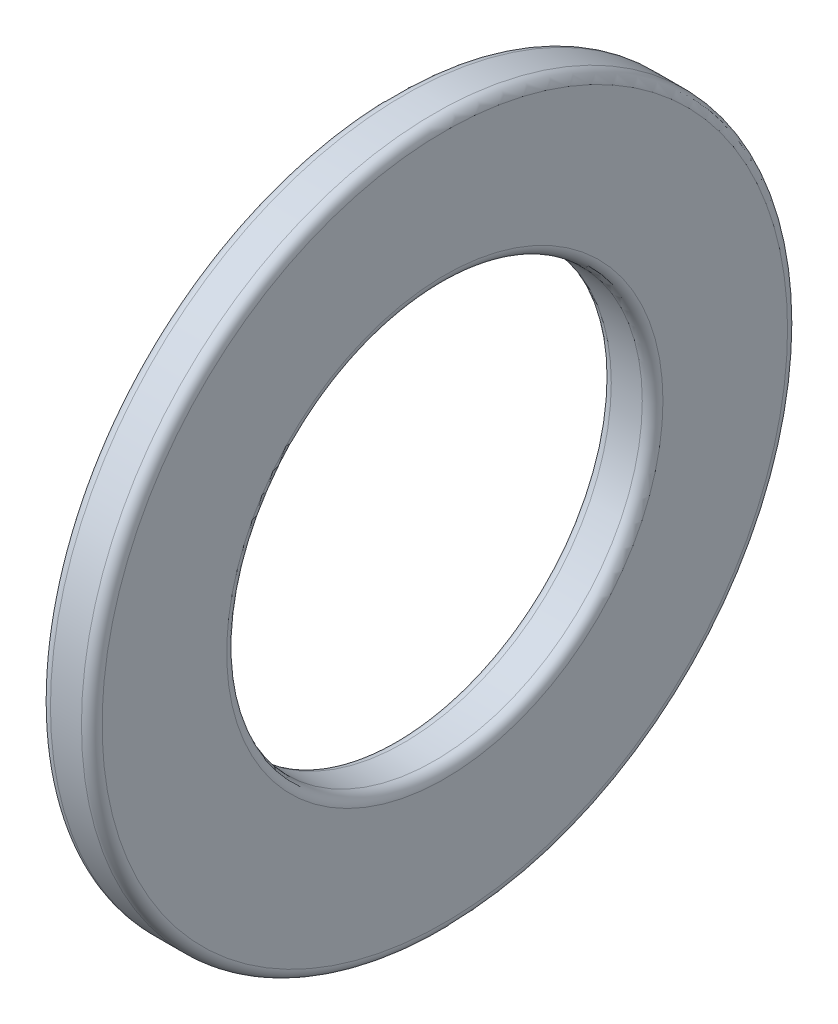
ISO-10303-21;
HEADER;
FILE_DESCRIPTION(('STEP AP214'),'2;1');
FILE_NAME('part.step','',(''),(''),'','','');
FILE_SCHEMA(('AUTOMOTIVE_DESIGN { 1 0 10303 214 1 1 1 1 }'));
ENDSEC;
DATA;
#1=APPLICATION_CONTEXT('core data for automotive mechanical design processes');
#2=APPLICATION_PROTOCOL_DEFINITION('international standard','automotive_design',2000,#1);
#3=PRODUCT_CONTEXT('',#1,'mechanical');
#4=PRODUCT('Part','Part','',(#3));
#5=PRODUCT_RELATED_PRODUCT_CATEGORY('part','',(#4));
#6=PRODUCT_DEFINITION_FORMATION('','',#4);
#7=PRODUCT_DEFINITION_CONTEXT('part definition',#1,'design');
#8=PRODUCT_DEFINITION('design','',#6,#7);
#9=PRODUCT_DEFINITION_SHAPE('','',#8);
#10=(LENGTH_UNIT() NAMED_UNIT(*) SI_UNIT(.MILLI.,.METRE.));
#11=(NAMED_UNIT(*) PLANE_ANGLE_UNIT() SI_UNIT($,.RADIAN.));
#12=(NAMED_UNIT(*) SI_UNIT($,.STERADIAN.) SOLID_ANGLE_UNIT());
#13=UNCERTAINTY_MEASURE_WITH_UNIT(LENGTH_MEASURE(1.E-05),#10,'distance_accuracy_value','');
#14=(GEOMETRIC_REPRESENTATION_CONTEXT(3) GLOBAL_UNCERTAINTY_ASSIGNED_CONTEXT((#13)) GLOBAL_UNIT_ASSIGNED_CONTEXT((#10,
#11,#12)) REPRESENTATION_CONTEXT('',''));
#15=CARTESIAN_POINT('',(0.,0.,0.));
#16=DIRECTION('',(0.,0.,1.));
#17=DIRECTION('',(1.,0.,0.));
#18=AXIS2_PLACEMENT_3D('',#15,#16,#17);
#19=CARTESIAN_POINT('',(0.8128,0.,0.));
#20=DIRECTION('',(1.,0.,0.));
#21=DIRECTION('',(0.,0.,-1.));
#22=AXIS2_PLACEMENT_3D('',#19,#20,#21);
#23=PLANE('',#22);
#24=CARTESIAN_POINT('',(0.8128,0.,0.));
#25=DIRECTION('',(1.,0.,0.));
#26=DIRECTION('',(0.,0.,-1.));
#27=AXIS2_PLACEMENT_3D('',#24,#25,#26);
#28=CIRCLE('',#27,10.78738);
#29=CARTESIAN_POINT('',(0.8128,0.,-10.78738));
#30=VERTEX_POINT('',#29);
#31=EDGE_CURVE('E79',#30,#30,#28,.T.);
#32=ORIENTED_EDGE('',*,*,#31,.T.);
#33=EDGE_LOOP('',(#32));
#34=FACE_BOUND('',#33,.T.);
#35=CARTESIAN_POINT('',(0.8128,0.,0.));
#36=DIRECTION('',(1.,0.,0.));
#37=DIRECTION('',(0.,0.,-1.));
#38=AXIS2_PLACEMENT_3D('',#35,#36,#37);
#39=CIRCLE('',#38,6.86562);
#40=CARTESIAN_POINT('',(0.8128,0.,-6.86562));
#41=VERTEX_POINT('',#40);
#42=EDGE_CURVE('E84',#41,#41,#39,.F.);
#43=ORIENTED_EDGE('',*,*,#42,.T.);
#44=EDGE_LOOP('',(#43));
#45=FACE_BOUND('',#44,.T.);
#46=ADVANCED_FACE('F44',(#34,#45),#23,.T.);
#47=CARTESIAN_POINT('',(-0.8128,0.,0.));
#48=DIRECTION('',(1.,0.,0.));
#49=DIRECTION('',(0.,0.,-1.));
#50=AXIS2_PLACEMENT_3D('',#47,#48,#49);
#51=PLANE('',#50);
#52=CARTESIAN_POINT('',(-0.8128,0.,0.));
#53=DIRECTION('',(1.,0.,0.));
#54=DIRECTION('',(0.,0.,-1.));
#55=AXIS2_PLACEMENT_3D('',#52,#53,#54);
#56=CIRCLE('',#55,10.78738);
#57=CARTESIAN_POINT('',(-0.8128,0.,-10.78738));
#58=VERTEX_POINT('',#57);
#59=EDGE_CURVE('E56',#58,#58,#56,.F.);
#60=ORIENTED_EDGE('',*,*,#59,.T.);
#61=EDGE_LOOP('',(#60));
#62=FACE_BOUND('',#61,.T.);
#63=CARTESIAN_POINT('',(-0.8128,0.,0.));
#64=DIRECTION('',(1.,0.,0.));
#65=DIRECTION('',(0.,0.,-1.));
#66=AXIS2_PLACEMENT_3D('',#63,#64,#65);
#67=CIRCLE('',#66,6.86562);
#68=CARTESIAN_POINT('',(-0.8128,0.,-6.86562));
#69=VERTEX_POINT('',#68);
#70=EDGE_CURVE('E63',#69,#69,#67,.T.);
#71=ORIENTED_EDGE('',*,*,#70,.T.);
#72=EDGE_LOOP('',(#71));
#73=FACE_BOUND('',#72,.T.);
#74=ADVANCED_FACE('F101',(#62,#73),#51,.F.);
#75=CARTESIAN_POINT('',(0.8128,0.,0.));
#76=DIRECTION('',(-1.,0.,0.));
#77=DIRECTION('',(0.,0.,1.));
#78=AXIS2_PLACEMENT_3D('',#75,#76,#77);
#79=CYLINDRICAL_SURFACE('',#78,11.1125);
#80=CARTESIAN_POINT('',(0.48768,0.,0.));
#81=DIRECTION('',(1.,0.,0.));
#82=DIRECTION('',(0.,0.,-1.));
#83=AXIS2_PLACEMENT_3D('',#80,#81,#82);
#84=CIRCLE('',#83,11.1125);
#85=CARTESIAN_POINT('',(0.48768,0.,-11.1125));
#86=VERTEX_POINT('',#85);
#87=EDGE_CURVE('E71',#86,#86,#84,.F.);
#88=ORIENTED_EDGE('',*,*,#87,.T.);
#89=EDGE_LOOP('',(#88));
#90=FACE_BOUND('',#89,.T.);
#91=CARTESIAN_POINT('',(-0.48768,0.,0.));
#92=DIRECTION('',(1.,0.,0.));
#93=DIRECTION('',(0.,0.,-1.));
#94=AXIS2_PLACEMENT_3D('',#91,#92,#93);
#95=CIRCLE('',#94,11.1125);
#96=CARTESIAN_POINT('',(-0.48768,0.,-11.1125));
#97=VERTEX_POINT('',#96);
#98=EDGE_CURVE('E74',#97,#97,#95,.T.);
#99=ORIENTED_EDGE('',*,*,#98,.T.);
#100=EDGE_LOOP('',(#99));
#101=FACE_BOUND('',#100,.T.);
#102=ADVANCED_FACE('F107',(#90,#101),#79,.T.);
#103=CARTESIAN_POINT('',(0.8128,0.,0.));
#104=DIRECTION('',(-1.,0.,0.));
#105=DIRECTION('',(0.,0.,1.));
#106=AXIS2_PLACEMENT_3D('',#103,#104,#105);
#107=CYLINDRICAL_SURFACE('',#106,6.5405);
#108=CARTESIAN_POINT('',(0.48768,0.,0.));
#109=DIRECTION('',(1.,0.,0.));
#110=DIRECTION('',(0.,0.,-1.));
#111=AXIS2_PLACEMENT_3D('',#108,#109,#110);
#112=CIRCLE('',#111,6.5405);
#113=CARTESIAN_POINT('',(0.48768,0.,-6.5405));
#114=VERTEX_POINT('',#113);
#115=EDGE_CURVE('E10',#114,#114,#112,.T.);
#116=ORIENTED_EDGE('',*,*,#115,.T.);
#117=EDGE_LOOP('',(#116));
#118=FACE_BOUND('',#117,.T.);
#119=CARTESIAN_POINT('',(-0.48768,0.,0.));
#120=DIRECTION('',(1.,0.,0.));
#121=DIRECTION('',(0.,0.,-1.));
#122=AXIS2_PLACEMENT_3D('',#119,#120,#121);
#123=CIRCLE('',#122,6.5405);
#124=CARTESIAN_POINT('',(-0.48768,0.,-6.5405));
#125=VERTEX_POINT('',#124);
#126=EDGE_CURVE('E52',#125,#125,#123,.F.);
#127=ORIENTED_EDGE('',*,*,#126,.T.);
#128=EDGE_LOOP('',(#127));
#129=FACE_BOUND('',#128,.T.);
#130=ADVANCED_FACE('F113',(#118,#129),#107,.F.);
#131=CARTESIAN_POINT('',(0.48768,0.,0.));
#132=DIRECTION('',(1.,0.,0.));
#133=DIRECTION('',(0.,0.,-1.));
#134=AXIS2_PLACEMENT_3D('',#131,#132,#133);
#135=TOROIDAL_SURFACE('',#134,10.78738,0.32512);
#136=ORIENTED_EDGE('',*,*,#87,.F.);
#137=EDGE_LOOP('',(#136));
#138=FACE_BOUND('',#137,.T.);
#139=ORIENTED_EDGE('',*,*,#31,.F.);
#140=EDGE_LOOP('',(#139));
#141=FACE_BOUND('',#140,.T.);
#142=ADVANCED_FACE('F100',(#138,#141),#135,.T.);
#143=CARTESIAN_POINT('',(-0.48768,0.,0.));
#144=DIRECTION('',(1.,0.,0.));
#145=DIRECTION('',(0.,0.,-1.));
#146=AXIS2_PLACEMENT_3D('',#143,#144,#145);
#147=TOROIDAL_SURFACE('',#146,10.78738,0.32512);
#148=ORIENTED_EDGE('',*,*,#59,.F.);
#149=EDGE_LOOP('',(#148));
#150=FACE_BOUND('',#149,.T.);
#151=ORIENTED_EDGE('',*,*,#98,.F.);
#152=EDGE_LOOP('',(#151));
#153=FACE_BOUND('',#152,.T.);
#154=ADVANCED_FACE('F94',(#150,#153),#147,.T.);
#155=CARTESIAN_POINT('',(0.48768,0.,0.));
#156=DIRECTION('',(1.,0.,0.));
#157=DIRECTION('',(0.,0.,-1.));
#158=AXIS2_PLACEMENT_3D('',#155,#156,#157);
#159=TOROIDAL_SURFACE('',#158,6.86562,0.32512);
#160=ORIENTED_EDGE('',*,*,#42,.F.);
#161=EDGE_LOOP('',(#160));
#162=FACE_BOUND('',#161,.T.);
#163=ORIENTED_EDGE('',*,*,#115,.F.);
#164=EDGE_LOOP('',(#163));
#165=FACE_BOUND('',#164,.T.);
#166=ADVANCED_FACE('F87',(#162,#165),#159,.T.);
#167=CARTESIAN_POINT('',(-0.48768,0.,0.));
#168=DIRECTION('',(1.,0.,0.));
#169=DIRECTION('',(0.,0.,-1.));
#170=AXIS2_PLACEMENT_3D('',#167,#168,#169);
#171=TOROIDAL_SURFACE('',#170,6.86562,0.32512);
#172=ORIENTED_EDGE('',*,*,#126,.F.);
#173=EDGE_LOOP('',(#172));
#174=FACE_BOUND('',#173,.T.);
#175=ORIENTED_EDGE('',*,*,#70,.F.);
#176=EDGE_LOOP('',(#175));
#177=FACE_BOUND('',#176,.T.);
#178=ADVANCED_FACE('F50',(#174,#177),#171,.T.);
#179=CLOSED_SHELL('',(#46,#74,#102,#130,#142,#154,#166,#178));
#180=MANIFOLD_SOLID_BREP('B2',#179);
#181=ADVANCED_BREP_SHAPE_REPRESENTATION('',(#18,#180),#14);
#182=SHAPE_DEFINITION_REPRESENTATION(#9,#181);
ENDSEC;
END-ISO-10303-21;
